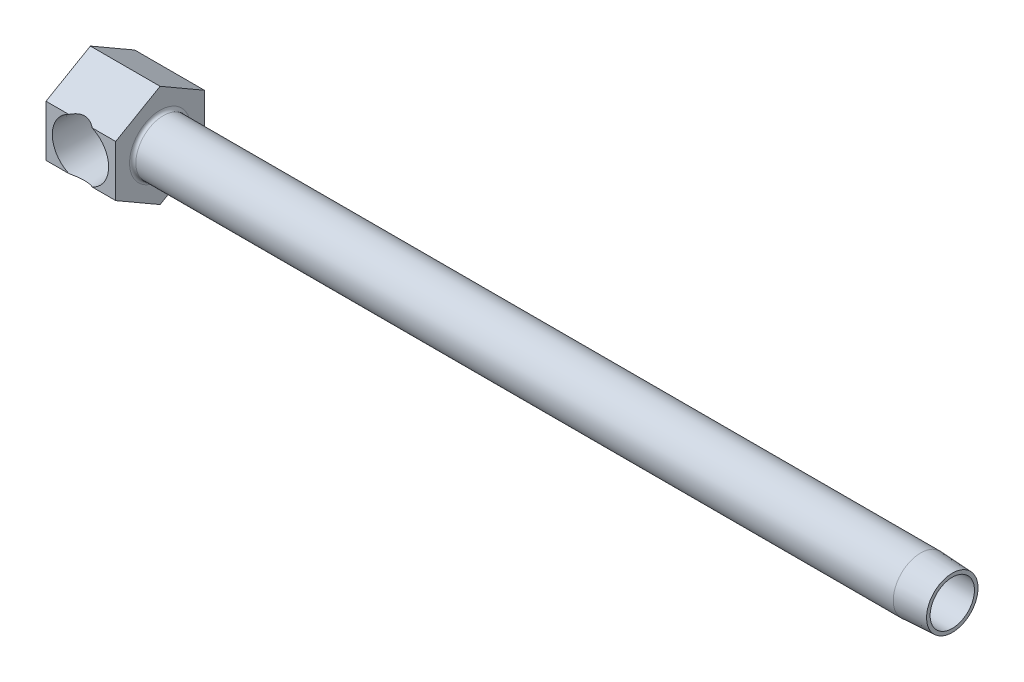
ISO-10303-21;
HEADER;
FILE_DESCRIPTION(('STEP AP214'),'2;1');
FILE_NAME('part.step','',(''),(''),'','','');
FILE_SCHEMA(('AUTOMOTIVE_DESIGN { 1 0 10303 214 1 1 1 1 }'));
ENDSEC;
DATA;
#1=APPLICATION_CONTEXT('core data for automotive mechanical design processes');
#2=APPLICATION_PROTOCOL_DEFINITION('international standard','automotive_design',2000,#1);
#3=PRODUCT_CONTEXT('',#1,'mechanical');
#4=PRODUCT('Part','Part','',(#3));
#5=PRODUCT_RELATED_PRODUCT_CATEGORY('part','',(#4));
#6=PRODUCT_DEFINITION_FORMATION('','',#4);
#7=PRODUCT_DEFINITION_CONTEXT('part definition',#1,'design');
#8=PRODUCT_DEFINITION('design','',#6,#7);
#9=PRODUCT_DEFINITION_SHAPE('','',#8);
#10=(LENGTH_UNIT() NAMED_UNIT(*) SI_UNIT(.MILLI.,.METRE.));
#11=(NAMED_UNIT(*) PLANE_ANGLE_UNIT() SI_UNIT($,.RADIAN.));
#12=(NAMED_UNIT(*) SI_UNIT($,.STERADIAN.) SOLID_ANGLE_UNIT());
#13=UNCERTAINTY_MEASURE_WITH_UNIT(LENGTH_MEASURE(1.E-05),#10,'distance_accuracy_value','');
#14=(GEOMETRIC_REPRESENTATION_CONTEXT(3) GLOBAL_UNCERTAINTY_ASSIGNED_CONTEXT((#13)) GLOBAL_UNIT_ASSIGNED_CONTEXT((#10,
#11,#12)) REPRESENTATION_CONTEXT('',''));
#15=CARTESIAN_POINT('',(0.,0.,0.));
#16=DIRECTION('',(0.,0.,1.));
#17=DIRECTION('',(1.,0.,0.));
#18=AXIS2_PLACEMENT_3D('',#15,#16,#17);
#19=CARTESIAN_POINT('',(63.5,0.,11.1125));
#20=DIRECTION('',(-1.,0.,0.));
#21=DIRECTION('',(0.,0.,1.));
#22=AXIS2_PLACEMENT_3D('',#19,#20,#21);
#23=CYLINDRICAL_SURFACE('',#22,6.858);
#24=CARTESIAN_POINT('',(18.2499,0.,11.1125));
#25=DIRECTION('',(-1.,0.,0.));
#26=DIRECTION('',(0.,-1.,0.));
#27=AXIS2_PLACEMENT_3D('',#24,#25,#26);
#28=CIRCLE('',#27,6.858);
#29=CARTESIAN_POINT('',(18.2499,-6.858,11.1125));
#30=VERTEX_POINT('',#29);
#31=EDGE_CURVE('E174',#30,#30,#28,.F.);
#32=ORIENTED_EDGE('',*,*,#31,.T.);
#33=EDGE_LOOP('',(#32));
#34=FACE_BOUND('',#33,.T.);
#35=CARTESIAN_POINT('',(207.9752,0.,11.1125));
#36=DIRECTION('',(1.,0.,0.));
#37=DIRECTION('',(0.,0.,-1.));
#38=AXIS2_PLACEMENT_3D('',#35,#36,#37);
#39=CIRCLE('',#38,6.858);
#40=CARTESIAN_POINT('',(207.9752,0.,4.2545));
#41=VERTEX_POINT('',#40);
#42=EDGE_CURVE('E218',#41,#41,#39,.T.);
#43=ORIENTED_EDGE('',*,*,#42,.F.);
#44=EDGE_LOOP('',(#43));
#45=FACE_BOUND('',#44,.T.);
#46=ADVANCED_FACE('F15',(#34,#45),#23,.T.);
#47=CARTESIAN_POINT('',(17.4625,6.4158048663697,22.225));
#48=DIRECTION('',(0.,0.,-1.));
#49=DIRECTION('',(0.,1.,0.));
#50=AXIS2_PLACEMENT_3D('',#47,#48,#49);
#51=PLANE('',#50);
#52=CARTESIAN_POINT('',(8.636,0.,22.225));
#53=DIRECTION('',(0.,0.,1.));
#54=DIRECTION('',(1.,0.,0.));
#55=AXIS2_PLACEMENT_3D('',#52,#53,#54);
#56=CIRCLE('',#55,7.05231);
#57=CARTESIAN_POINT('',(5.70811266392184,6.4158048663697,22.225));
#58=VERTEX_POINT('',#57);
#59=CARTESIAN_POINT('',(5.70811266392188,-6.41580486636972,22.225));
#60=VERTEX_POINT('',#59);
#61=EDGE_CURVE('E229',#58,#60,#56,.T.);
#62=ORIENTED_EDGE('',*,*,#61,.F.);
#63=DIRECTION('',(-1.,0.,0.));
#64=VECTOR('',#63,1.);
#65=CARTESIAN_POINT('',(17.4625,6.4158048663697,22.225));
#66=LINE('',#65,#64);
#67=CARTESIAN_POINT('',(0.,6.4158048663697,22.225));
#68=VERTEX_POINT('',#67);
#69=EDGE_CURVE('E158',#58,#68,#66,.T.);
#70=ORIENTED_EDGE('',*,*,#69,.T.);
#71=DIRECTION('',(0.,-1.,0.));
#72=VECTOR('',#71,1.);
#73=CARTESIAN_POINT('',(0.,6.4158048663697,22.225));
#74=LINE('',#73,#72);
#75=CARTESIAN_POINT('',(0.,-6.41580486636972,22.225));
#76=VERTEX_POINT('',#75);
#77=EDGE_CURVE('E128',#68,#76,#74,.T.);
#78=ORIENTED_EDGE('',*,*,#77,.T.);
#79=DIRECTION('',(-1.,0.,0.));
#80=VECTOR('',#79,1.);
#81=CARTESIAN_POINT('',(17.4625,-6.41580486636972,22.225));
#82=LINE('',#81,#80);
#83=EDGE_CURVE('E154',#60,#76,#82,.T.);
#84=ORIENTED_EDGE('',*,*,#83,.F.);
#85=EDGE_LOOP('',(#62,#70,#78,#84));
#86=FACE_BOUND('',#85,.T.);
#87=ADVANCED_FACE('F205',(#86),#51,.F.);
#88=CARTESIAN_POINT('',(11.5638873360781,-6.41580486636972,22.225));
#89=VERTEX_POINT('',#88);
#90=CARTESIAN_POINT('',(11.5638873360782,6.4158048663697,22.225));
#91=VERTEX_POINT('',#90);
#92=EDGE_CURVE('E228',#89,#91,#56,.T.);
#93=ORIENTED_EDGE('',*,*,#92,.F.);
#94=CARTESIAN_POINT('',(17.4625,-6.41580486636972,22.225));
#95=VERTEX_POINT('',#94);
#96=EDGE_CURVE('E155',#95,#89,#82,.T.);
#97=ORIENTED_EDGE('',*,*,#96,.F.);
#98=DIRECTION('',(0.,-1.,0.));
#99=VECTOR('',#98,1.);
#100=CARTESIAN_POINT('',(17.4625,6.4158048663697,22.225));
#101=LINE('',#100,#99);
#102=CARTESIAN_POINT('',(17.4625,6.4158048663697,22.225));
#103=VERTEX_POINT('',#102);
#104=EDGE_CURVE('E145',#103,#95,#101,.T.);
#105=ORIENTED_EDGE('',*,*,#104,.F.);
#106=EDGE_CURVE('E159',#103,#91,#66,.T.);
#107=ORIENTED_EDGE('',*,*,#106,.T.);
#108=EDGE_LOOP('',(#93,#97,#105,#107));
#109=FACE_BOUND('',#108,.T.);
#110=ADVANCED_FACE('F211',(#109),#51,.F.);
#111=CARTESIAN_POINT('',(17.4625,12.8316097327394,11.1125));
#112=DIRECTION('',(0.,-0.866025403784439,-0.5));
#113=DIRECTION('',(0.,0.5,-0.866025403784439));
#114=AXIS2_PLACEMENT_3D('',#111,#112,#113);
#115=PLANE('',#114);
#116=ORIENTED_EDGE('',*,*,#69,.F.);
#117=CARTESIAN_POINT('',(8.636,-0.384020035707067,34.002642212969));
#118=DIRECTION('',(0.,-0.866025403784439,-0.5));
#119=DIRECTION('',(0.,-0.5,0.866025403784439));
#120=AXIS2_PLACEMENT_3D('',#117,#118,#119);
#121=ELLIPSE('',#120,14.8098967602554,7.39498405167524);
#122=EDGE_CURVE('E109',#58,#91,#121,.T.);
#123=ORIENTED_EDGE('',*,*,#122,.T.);
#124=ORIENTED_EDGE('',*,*,#106,.F.);
#125=DIRECTION('',(0.,-0.5,0.866025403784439));
#126=VECTOR('',#125,1.);
#127=CARTESIAN_POINT('',(17.4625,12.8316097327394,11.1125));
#128=LINE('',#127,#126);
#129=CARTESIAN_POINT('',(17.4625,12.8316097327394,11.1125));
#130=VERTEX_POINT('',#129);
#131=EDGE_CURVE('E143',#130,#103,#128,.T.);
#132=ORIENTED_EDGE('',*,*,#131,.F.);
#133=DIRECTION('',(-1.,0.,0.));
#134=VECTOR('',#133,1.);
#135=CARTESIAN_POINT('',(17.4625,12.8316097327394,11.1125));
#136=LINE('',#135,#134);
#137=CARTESIAN_POINT('',(0.,12.8316097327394,11.1125));
#138=VERTEX_POINT('',#137);
#139=EDGE_CURVE('E162',#130,#138,#136,.T.);
#140=ORIENTED_EDGE('',*,*,#139,.T.);
#141=DIRECTION('',(0.,-0.5,0.866025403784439));
#142=VECTOR('',#141,1.);
#143=CARTESIAN_POINT('',(0.,12.8316097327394,11.1125));
#144=LINE('',#143,#142);
#145=EDGE_CURVE('E124',#138,#68,#144,.T.);
#146=ORIENTED_EDGE('',*,*,#145,.T.);
#147=EDGE_LOOP('',(#116,#123,#124,#132,#140,#146));
#148=FACE_BOUND('',#147,.T.);
#149=ADVANCED_FACE('F257',(#148),#115,.F.);
#150=CARTESIAN_POINT('',(17.4625,-6.41580486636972,22.225));
#151=DIRECTION('',(0.,0.866025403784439,-0.5));
#152=DIRECTION('',(0.,0.5,0.866025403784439));
#153=AXIS2_PLACEMENT_3D('',#150,#151,#152);
#154=PLANE('',#153);
#155=ORIENTED_EDGE('',*,*,#96,.T.);
#156=CARTESIAN_POINT('',(8.636,0.384020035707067,34.0026422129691));
#157=DIRECTION('',(0.,0.866025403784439,-0.5));
#158=DIRECTION('',(0.,0.5,0.866025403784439));
#159=AXIS2_PLACEMENT_3D('',#156,#157,#158);
#160=ELLIPSE('',#159,14.8098967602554,7.39498405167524);
#161=EDGE_CURVE('E34',#89,#60,#160,.T.);
#162=ORIENTED_EDGE('',*,*,#161,.T.);
#163=ORIENTED_EDGE('',*,*,#83,.T.);
#164=DIRECTION('',(0.,-0.5,-0.866025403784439));
#165=VECTOR('',#164,1.);
#166=CARTESIAN_POINT('',(0.,-6.41580486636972,22.225));
#167=LINE('',#166,#165);
#168=CARTESIAN_POINT('',(0.,-12.8316097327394,11.1125));
#169=VERTEX_POINT('',#168);
#170=EDGE_CURVE('E132',#76,#169,#167,.T.);
#171=ORIENTED_EDGE('',*,*,#170,.T.);
#172=DIRECTION('',(-1.,0.,0.));
#173=VECTOR('',#172,1.);
#174=CARTESIAN_POINT('',(17.4625,-12.8316097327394,11.1125));
#175=LINE('',#174,#173);
#176=CARTESIAN_POINT('',(17.4625,-12.8316097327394,11.1125));
#177=VERTEX_POINT('',#176);
#178=EDGE_CURVE('E149',#177,#169,#175,.T.);
#179=ORIENTED_EDGE('',*,*,#178,.F.);
#180=DIRECTION('',(0.,-0.5,-0.866025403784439));
#181=VECTOR('',#180,1.);
#182=CARTESIAN_POINT('',(17.4625,-6.41580486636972,22.225));
#183=LINE('',#182,#181);
#184=EDGE_CURVE('E147',#95,#177,#183,.T.);
#185=ORIENTED_EDGE('',*,*,#184,.F.);
#186=EDGE_LOOP('',(#155,#162,#163,#171,#179,#185));
#187=FACE_BOUND('',#186,.T.);
#188=ADVANCED_FACE('F235',(#187),#154,.F.);
#189=CARTESIAN_POINT('',(17.4625,-12.8316097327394,11.1125));
#190=DIRECTION('',(0.,0.866025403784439,0.5));
#191=DIRECTION('',(0.,-0.5,0.866025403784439));
#192=AXIS2_PLACEMENT_3D('',#189,#190,#191);
#193=PLANE('',#192);
#194=DIRECTION('',(0.,0.5,-0.866025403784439));
#195=VECTOR('',#194,1.);
#196=CARTESIAN_POINT('',(0.,-12.8316097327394,11.1125));
#197=LINE('',#196,#195);
#198=CARTESIAN_POINT('',(0.,-6.41580486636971,0.));
#199=VERTEX_POINT('',#198);
#200=EDGE_CURVE('E117',#169,#199,#197,.T.);
#201=ORIENTED_EDGE('',*,*,#200,.T.);
#202=DIRECTION('',(-1.,0.,0.));
#203=VECTOR('',#202,1.);
#204=CARTESIAN_POINT('',(17.4625,-6.41580486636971,0.));
#205=LINE('',#204,#203);
#206=CARTESIAN_POINT('',(17.4625,-6.41580486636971,0.));
#207=VERTEX_POINT('',#206);
#208=EDGE_CURVE('E168',#207,#199,#205,.T.);
#209=ORIENTED_EDGE('',*,*,#208,.F.);
#210=DIRECTION('',(0.,0.5,-0.866025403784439));
#211=VECTOR('',#210,1.);
#212=CARTESIAN_POINT('',(17.4625,-12.8316097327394,11.1125));
#213=LINE('',#212,#211);
#214=EDGE_CURVE('E135',#177,#207,#213,.T.);
#215=ORIENTED_EDGE('',*,*,#214,.F.);
#216=ORIENTED_EDGE('',*,*,#178,.T.);
#217=EDGE_LOOP('',(#201,#209,#215,#216));
#218=FACE_BOUND('',#217,.T.);
#219=ADVANCED_FACE('F247',(#218),#193,.F.);
#220=CARTESIAN_POINT('',(17.4625,-6.41580486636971,0.));
#221=DIRECTION('',(0.,0.,1.));
#222=DIRECTION('',(1.,0.,0.));
#223=AXIS2_PLACEMENT_3D('',#220,#221,#222);
#224=PLANE('',#223);
#225=DIRECTION('',(0.,1.,0.));
#226=VECTOR('',#225,1.);
#227=CARTESIAN_POINT('',(0.,-6.41580486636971,0.));
#228=LINE('',#227,#226);
#229=CARTESIAN_POINT('',(0.,6.41580486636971,0.));
#230=VERTEX_POINT('',#229);
#231=EDGE_CURVE('E118',#199,#230,#228,.T.);
#232=ORIENTED_EDGE('',*,*,#231,.T.);
#233=DIRECTION('',(-1.,0.,0.));
#234=VECTOR('',#233,1.);
#235=CARTESIAN_POINT('',(17.4625,6.41580486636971,0.));
#236=LINE('',#235,#234);
#237=CARTESIAN_POINT('',(17.4625,6.41580486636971,0.));
#238=VERTEX_POINT('',#237);
#239=EDGE_CURVE('E165',#238,#230,#236,.T.);
#240=ORIENTED_EDGE('',*,*,#239,.F.);
#241=DIRECTION('',(0.,1.,0.));
#242=VECTOR('',#241,1.);
#243=CARTESIAN_POINT('',(17.4625,-6.41580486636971,0.));
#244=LINE('',#243,#242);
#245=EDGE_CURVE('E139',#207,#238,#244,.T.);
#246=ORIENTED_EDGE('',*,*,#245,.F.);
#247=ORIENTED_EDGE('',*,*,#208,.T.);
#248=EDGE_LOOP('',(#232,#240,#246,#247));
#249=FACE_BOUND('',#248,.T.);
#250=ADVANCED_FACE('F264',(#249),#224,.F.);
#251=CARTESIAN_POINT('',(17.4625,6.4158048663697,0.));
#252=DIRECTION('',(0.,-0.866025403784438,0.5));
#253=DIRECTION('',(0.,-0.5,-0.866025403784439));
#254=AXIS2_PLACEMENT_3D('',#251,#252,#253);
#255=PLANE('',#254);
#256=DIRECTION('',(0.,0.5,0.866025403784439));
#257=VECTOR('',#256,1.);
#258=CARTESIAN_POINT('',(0.,6.4158048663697,0.));
#259=LINE('',#258,#257);
#260=EDGE_CURVE('E121',#230,#138,#259,.T.);
#261=ORIENTED_EDGE('',*,*,#260,.T.);
#262=ORIENTED_EDGE('',*,*,#139,.F.);
#263=DIRECTION('',(0.,0.5,0.866025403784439));
#264=VECTOR('',#263,1.);
#265=CARTESIAN_POINT('',(17.4625,6.4158048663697,0.));
#266=LINE('',#265,#264);
#267=EDGE_CURVE('E141',#238,#130,#266,.T.);
#268=ORIENTED_EDGE('',*,*,#267,.F.);
#269=ORIENTED_EDGE('',*,*,#239,.T.);
#270=EDGE_LOOP('',(#261,#262,#268,#269));
#271=FACE_BOUND('',#270,.T.);
#272=ADVANCED_FACE('F261',(#271),#255,.F.);
#273=CARTESIAN_POINT('',(17.4625,-19.2474145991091,22.225));
#274=DIRECTION('',(-1.,0.,0.));
#275=DIRECTION('',(0.,-1.,0.));
#276=AXIS2_PLACEMENT_3D('',#273,#274,#275);
#277=PLANE('',#276);
#278=CARTESIAN_POINT('',(17.4625,0.,11.1125));
#279=DIRECTION('',(-1.,0.,0.));
#280=DIRECTION('',(0.,-1.,0.));
#281=AXIS2_PLACEMENT_3D('',#278,#279,#280);
#282=CIRCLE('',#281,7.6454);
#283=CARTESIAN_POINT('',(17.4625,-7.6454,11.1125));
#284=VERTEX_POINT('',#283);
#285=EDGE_CURVE('E171',#284,#284,#282,.T.);
#286=ORIENTED_EDGE('',*,*,#285,.T.);
#287=EDGE_LOOP('',(#286));
#288=FACE_BOUND('',#287,.T.);
#289=ORIENTED_EDGE('',*,*,#214,.T.);
#290=ORIENTED_EDGE('',*,*,#245,.T.);
#291=ORIENTED_EDGE('',*,*,#267,.T.);
#292=ORIENTED_EDGE('',*,*,#131,.T.);
#293=ORIENTED_EDGE('',*,*,#104,.T.);
#294=ORIENTED_EDGE('',*,*,#184,.T.);
#295=EDGE_LOOP('',(#289,#290,#291,#292,#293,#294));
#296=FACE_BOUND('',#295,.T.);
#297=ADVANCED_FACE('F250',(#288,#296),#277,.F.);
#298=CARTESIAN_POINT('',(0.,-19.2474145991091,22.225));
#299=DIRECTION('',(-1.,0.,0.));
#300=DIRECTION('',(0.,-1.,0.));
#301=AXIS2_PLACEMENT_3D('',#298,#299,#300);
#302=PLANE('',#301);
#303=ORIENTED_EDGE('',*,*,#200,.F.);
#304=ORIENTED_EDGE('',*,*,#170,.F.);
#305=ORIENTED_EDGE('',*,*,#77,.F.);
#306=ORIENTED_EDGE('',*,*,#145,.F.);
#307=ORIENTED_EDGE('',*,*,#260,.F.);
#308=ORIENTED_EDGE('',*,*,#231,.F.);
#309=EDGE_LOOP('',(#303,#304,#305,#306,#307,#308));
#310=FACE_BOUND('',#309,.T.);
#311=ADVANCED_FACE('F243',(#310),#302,.T.);
#312=CARTESIAN_POINT('',(18.2499,0.,11.1125));
#313=DIRECTION('',(-1.,0.,0.));
#314=DIRECTION('',(0.,-1.,0.));
#315=AXIS2_PLACEMENT_3D('',#312,#313,#314);
#316=TOROIDAL_SURFACE('',#315,7.6454,0.7874);
#317=ORIENTED_EDGE('',*,*,#31,.F.);
#318=EDGE_LOOP('',(#317));
#319=FACE_BOUND('',#318,.T.);
#320=ORIENTED_EDGE('',*,*,#285,.F.);
#321=EDGE_LOOP('',(#320));
#322=FACE_BOUND('',#321,.T.);
#323=ADVANCED_FACE('F282',(#319,#322),#316,.F.);
#324=CARTESIAN_POINT('',(63.5,0.,11.1125));
#325=DIRECTION('',(1.,0.,0.));
#326=DIRECTION('',(0.,0.,-1.));
#327=AXIS2_PLACEMENT_3D('',#324,#325,#326);
#328=CYLINDRICAL_SURFACE('',#327,5.5499);
#329=DIRECTION('',(1.,0.,0.));
#330=VECTOR('',#329,1.);
#331=CARTESIAN_POINT('',(63.5,1.29165930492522,5.715));
#332=LINE('',#331,#330);
#333=CARTESIAN_POINT('',(15.0655177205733,1.29165930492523,5.715));
#334=VERTEX_POINT('',#333);
#335=CARTESIAN_POINT('',(14.0465577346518,1.29165930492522,5.715));
#336=VERTEX_POINT('',#335);
#337=EDGE_CURVE('E27',#334,#336,#332,.F.);
#338=ORIENTED_EDGE('',*,*,#337,.T.);
#339=CARTESIAN_POINT('',(14.0465577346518,1.29165930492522,5.715));
#340=CARTESIAN_POINT('',(14.0725617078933,1.1828202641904,5.68893317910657));
#341=CARTESIAN_POINT('',(14.0954190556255,1.0724477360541,5.66602138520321));
#342=CARTESIAN_POINT('',(14.1345363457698,0.849345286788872,5.62681178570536));
#343=CARTESIAN_POINT('',(14.1507939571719,0.736614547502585,5.61051631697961));
#344=CARTESIAN_POINT('',(14.1760383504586,0.512691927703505,5.58521342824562));
#345=CARTESIAN_POINT('',(14.1852120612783,0.401542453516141,5.57601863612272));
#346=CARTESIAN_POINT('',(14.1968530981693,0.17856718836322,5.56435088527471));
#347=CARTESIAN_POINT('',(14.1993222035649,0.0667415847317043,5.56187614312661));
#348=CARTESIAN_POINT('',(14.1975723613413,-0.14949882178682,5.56362999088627));
#349=CARTESIAN_POINT('',(14.193779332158,-0.253921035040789,5.56743168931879));
#350=CARTESIAN_POINT('',(14.1803598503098,-0.462026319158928,5.58088200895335));
#351=CARTESIAN_POINT('',(14.1707325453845,-0.565709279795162,5.59053148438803));
#352=CARTESIAN_POINT('',(14.1454600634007,-0.774399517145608,5.61586264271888));
#353=CARTESIAN_POINT('',(14.12966315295,-0.87936981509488,5.63169642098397));
#354=CARTESIAN_POINT('',(14.092340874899,-1.08722287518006,5.6691068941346));
#355=CARTESIAN_POINT('',(14.0708169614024,-1.1901061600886,5.69068213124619));
#356=CARTESIAN_POINT('',(14.0465577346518,-1.29165930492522,5.715));
#357=B_SPLINE_CURVE_WITH_KNOTS('',3,(#339,#340,#341,#342,#343,#344,#345,#346,#347,#348,#349,
#350,#351,#352,#353,#354,#355,#356),.UNSPECIFIED.,.F.,.F.,(4,2,2,2,2,2,2,2,4),(0.,
0.344637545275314,0.689396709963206,1.02471413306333,1.35994255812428,1.67329546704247,
1.98669416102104,2.30834220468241,2.62990865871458),.UNSPECIFIED.);
#358=CARTESIAN_POINT('',(14.0465577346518,-1.29165930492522,5.715));
#359=VERTEX_POINT('',#358);
#360=EDGE_CURVE('E10',#336,#359,#357,.T.);
#361=ORIENTED_EDGE('',*,*,#360,.T.);
#362=DIRECTION('',(1.,0.,0.));
#363=VECTOR('',#362,1.);
#364=CARTESIAN_POINT('',(63.5,-1.29165930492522,5.715));
#365=LINE('',#364,#363);
#366=CARTESIAN_POINT('',(15.0655177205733,-1.29165930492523,5.715));
#367=VERTEX_POINT('',#366);
#368=EDGE_CURVE('E184',#359,#367,#365,.T.);
#369=ORIENTED_EDGE('',*,*,#368,.T.);
#370=CARTESIAN_POINT('',(15.0656795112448,-1.29082327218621,5.71480000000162));
#371=CARTESIAN_POINT('',(15.0372536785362,-1.43791824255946,5.7499521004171));
#372=CARTESIAN_POINT('',(15.0041876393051,-1.58262926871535,5.79093746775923));
#373=CARTESIAN_POINT('',(14.9298152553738,-1.86616189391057,5.88364074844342));
#374=CARTESIAN_POINT('',(14.8885204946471,-2.00499144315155,5.93534357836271));
#375=CARTESIAN_POINT('',(14.7990709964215,-2.27477346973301,6.0481148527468));
#376=CARTESIAN_POINT('',(14.7509848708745,-2.40578805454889,6.10909004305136));
#377=CARTESIAN_POINT('',(14.6486806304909,-2.66083130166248,6.2399326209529));
#378=CARTESIAN_POINT('',(14.5944604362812,-2.78485757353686,6.30980302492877));
#379=CARTESIAN_POINT('',(14.4812536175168,-3.02482355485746,6.4572285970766));
#380=CARTESIAN_POINT('',(14.4222960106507,-3.1408054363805,6.53473755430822));
#381=CARTESIAN_POINT('',(14.3003856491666,-3.365215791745,6.6970845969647));
#382=CARTESIAN_POINT('',(14.2374332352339,-3.47364490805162,6.78192205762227));
#383=CARTESIAN_POINT('',(14.0435453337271,-3.78827180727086,7.04729631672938));
#384=CARTESIAN_POINT('',(13.9079456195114,-3.9830565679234,7.23822682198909));
#385=CARTESIAN_POINT('',(13.689310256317,-4.26816238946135,7.56146618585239));
#386=CARTESIAN_POINT('',(13.6074310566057,-4.3686517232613,7.68585924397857));
#387=CARTESIAN_POINT('',(13.4442899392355,-4.55879004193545,7.94320688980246));
#388=CARTESIAN_POINT('',(13.3630282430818,-4.6484352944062,8.07616440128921));
#389=CARTESIAN_POINT('',(13.2036424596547,-4.81645966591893,8.35044586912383));
#390=CARTESIAN_POINT('',(13.1255135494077,-4.89485662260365,8.49175606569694));
#391=CARTESIAN_POINT('',(12.9752684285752,-5.04004510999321,8.78316437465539));
#392=CARTESIAN_POINT('',(12.9031480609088,-5.10684469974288,8.93325628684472));
#393=CARTESIAN_POINT('',(12.757824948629,-5.23785122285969,9.26762207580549));
#394=CARTESIAN_POINT('',(12.686320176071,-5.29990617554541,9.45350692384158));
#395=CARTESIAN_POINT('',(12.5645322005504,-5.40502712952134,9.83721903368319));
#396=CARTESIAN_POINT('',(12.5142004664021,-5.44813656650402,10.035017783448));
#397=CARTESIAN_POINT('',(12.4606756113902,-5.49679755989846,10.3395644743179));
#398=CARTESIAN_POINT('',(12.4464754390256,-5.51038902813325,10.443158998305));
#399=CARTESIAN_POINT('',(12.4264834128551,-5.5317354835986,10.6517762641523));
#400=CARTESIAN_POINT('',(12.4206908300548,-5.53949097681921,10.7567988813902));
#401=CARTESIAN_POINT('',(12.4179376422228,-5.54899639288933,10.9671942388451));
#402=CARTESIAN_POINT('',(12.4209736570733,-5.55074861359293,11.0725668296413));
#403=CARTESIAN_POINT('',(12.4357182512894,-5.54828805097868,11.2826067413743));
#404=CARTESIAN_POINT('',(12.4474268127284,-5.54407527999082,11.3872740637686));
#405=CARTESIAN_POINT('',(12.4900727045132,-5.52483789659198,11.6684350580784));
#406=CARTESIAN_POINT('',(12.5287513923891,-5.5042766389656,11.8434168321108));
#407=CARTESIAN_POINT('',(12.6245766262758,-5.44793106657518,12.1856637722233));
#408=CARTESIAN_POINT('',(12.6817493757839,-5.41212512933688,12.3529176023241));
#409=CARTESIAN_POINT('',(12.8020710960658,-5.33165221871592,12.6608364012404));
#410=CARTESIAN_POINT('',(12.8638814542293,-5.28838367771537,12.8024081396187));
#411=CARTESIAN_POINT('',(12.9946271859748,-5.19196308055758,13.0788046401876));
#412=CARTESIAN_POINT('',(13.0635675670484,-5.13880405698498,13.2136245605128));
#413=CARTESIAN_POINT('',(13.2061680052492,-5.0230773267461,13.476991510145));
#414=CARTESIAN_POINT('',(13.2798387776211,-4.96048779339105,13.6055230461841));
#415=CARTESIAN_POINT('',(13.4297455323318,-4.82635797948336,13.8561944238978));
#416=CARTESIAN_POINT('',(13.505980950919,-4.75481965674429,13.9783356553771));
#417=CARTESIAN_POINT('',(13.664111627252,-4.59832635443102,14.2236446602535));
#418=CARTESIAN_POINT('',(13.7460684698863,-4.51281916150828,14.3464205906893));
#419=CARTESIAN_POINT('',(13.9094765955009,-4.33199713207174,14.5849036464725));
#420=CARTESIAN_POINT('',(13.9909278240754,-4.23668125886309,14.7006100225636));
#421=CARTESIAN_POINT('',(14.1517819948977,-4.03638256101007,14.9245234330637));
#422=CARTESIAN_POINT('',(14.231187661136,-3.93141354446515,15.0327408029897));
#423=CARTESIAN_POINT('',(14.3867175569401,-3.71172769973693,15.2413555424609));
#424=CARTESIAN_POINT('',(14.4628409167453,-3.59700831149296,15.3417508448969));
#425=CARTESIAN_POINT('',(14.668135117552,-3.26437402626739,15.6091426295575));
#426=CARTESIAN_POINT('',(14.7924014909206,-3.03572507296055,15.7670513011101));
#427=CARTESIAN_POINT('',(14.961823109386,-2.67104021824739,15.9794040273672));
#428=CARTESIAN_POINT('',(15.0154673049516,-2.54586009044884,16.0461031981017));
#429=CARTESIAN_POINT('',(15.1161712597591,-2.28856209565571,16.1705894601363));
#430=CARTESIAN_POINT('',(15.1632322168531,-2.15644549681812,16.2283781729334));
#431=CARTESIAN_POINT('',(15.2428146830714,-1.9076542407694,16.3256678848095));
#432=CARTESIAN_POINT('',(15.2764575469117,-1.79190088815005,16.3666154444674));
#433=CARTESIAN_POINT('',(15.3378292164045,-1.55651069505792,16.4410921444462));
#434=CARTESIAN_POINT('',(15.3655591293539,-1.43687458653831,16.4746226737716));
#435=CARTESIAN_POINT('',(15.4145953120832,-1.19439983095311,16.5337884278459));
#436=CARTESIAN_POINT('',(15.4359031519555,-1.0715619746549,16.5594255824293));
#437=CARTESIAN_POINT('',(15.4716760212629,-0.823504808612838,16.6024058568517));
#438=CARTESIAN_POINT('',(15.4861437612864,-0.698286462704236,16.6197522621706));
#439=CARTESIAN_POINT('',(15.5079865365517,-0.445852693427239,16.645922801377));
#440=CARTESIAN_POINT('',(15.5153340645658,-0.318631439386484,16.6547138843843));
#441=CARTESIAN_POINT('',(15.522677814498,-0.063671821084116,16.6635004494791));
#442=CARTESIAN_POINT('',(15.5226740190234,0.0640665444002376,16.6634959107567));
#443=CARTESIAN_POINT('',(15.5153149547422,0.319031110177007,16.6546910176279));
#444=CARTESIAN_POINT('',(15.5079593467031,0.446257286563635,16.64589025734));
#445=CARTESIAN_POINT('',(15.4860583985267,0.699182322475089,16.6196499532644));
#446=CARTESIAN_POINT('',(15.4715132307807,0.824881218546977,16.6022106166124));
#447=CARTESIAN_POINT('',(15.4365532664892,1.06681669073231,16.5602063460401));
#448=CARTESIAN_POINT('',(15.4165150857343,1.18318753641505,16.5360979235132));
#449=CARTESIAN_POINT('',(15.370668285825,1.41308832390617,16.4807930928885));
#450=CARTESIAN_POINT('',(15.3448577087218,1.52661728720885,16.4495942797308));
#451=CARTESIAN_POINT('',(15.2593968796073,1.8619852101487,16.3459550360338));
#452=CARTESIAN_POINT('',(15.1916934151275,2.07876635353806,16.2634431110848));
#453=CARTESIAN_POINT('',(15.0313088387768,2.51543897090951,16.0659794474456));
#454=CARTESIAN_POINT('',(14.9368359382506,2.73357267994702,15.9486491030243));
#455=CARTESIAN_POINT('',(14.7321201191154,3.14711164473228,15.6903358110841));
#456=CARTESIAN_POINT('',(14.6218705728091,3.34250728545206,15.549342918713));
#457=CARTESIAN_POINT('',(14.3660176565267,3.74896640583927,15.2149275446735));
#458=CARTESIAN_POINT('',(14.217881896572,3.95452519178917,15.0167316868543));
#459=CARTESIAN_POINT('',(13.9905991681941,4.23685264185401,14.7000501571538));
#460=CARTESIAN_POINT('',(13.9138995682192,4.32671599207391,14.5911203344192));
#461=CARTESIAN_POINT('',(13.7600052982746,4.49774000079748,14.366972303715));
#462=CARTESIAN_POINT('',(13.682810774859,4.57890311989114,14.2517558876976));
#463=CARTESIAN_POINT('',(13.5283146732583,4.73340315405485,14.0136509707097));
#464=CARTESIAN_POINT('',(13.4510233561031,4.80663208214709,13.8906858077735));
#465=CARTESIAN_POINT('',(13.2989020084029,4.94395744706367,13.6382338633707));
#466=CARTESIAN_POINT('',(13.2240725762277,5.00805167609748,13.5087455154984));
#467=CARTESIAN_POINT('',(13.0790371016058,5.12664196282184,13.2432341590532));
#468=CARTESIAN_POINT('',(13.0088235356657,5.18115389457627,13.107222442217));
#469=CARTESIAN_POINT('',(12.8755190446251,5.28008101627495,12.8283198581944));
#470=CARTESIAN_POINT('',(12.8124234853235,5.3245027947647,12.6854335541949));
#471=CARTESIAN_POINT('',(12.6833891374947,5.4112685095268,12.3591277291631));
#472=CARTESIAN_POINT('',(12.6200540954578,5.45085356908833,12.1738679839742));
#473=CARTESIAN_POINT('',(12.5423523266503,5.49611259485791,11.8892630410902));
#474=CARTESIAN_POINT('',(12.5193453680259,5.50884182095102,11.7933456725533));
#475=CARTESIAN_POINT('',(12.4799604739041,5.52933440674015,11.5996550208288));
#476=CARTESIAN_POINT('',(12.4635791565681,5.53710030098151,11.5018827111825));
#477=CARTESIAN_POINT('',(12.4380468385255,5.54748556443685,11.3040796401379));
#478=CARTESIAN_POINT('',(12.4289726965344,5.55005064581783,11.2040359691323));
#479=CARTESIAN_POINT('',(12.418786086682,5.54973569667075,11.0035516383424));
#480=CARTESIAN_POINT('',(12.4176731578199,5.54685598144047,10.9031110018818));
#481=CARTESIAN_POINT('',(12.4234254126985,5.53566138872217,10.7027211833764));
#482=CARTESIAN_POINT('',(12.4302942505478,5.52734402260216,10.6027722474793));
#483=CARTESIAN_POINT('',(12.4515981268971,5.5054275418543,10.4042328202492));
#484=CARTESIAN_POINT('',(12.4660373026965,5.4918255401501,10.3056431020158));
#485=CARTESIAN_POINT('',(12.5044721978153,5.45712893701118,10.0955734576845));
#486=CARTESIAN_POINT('',(12.5295946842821,5.43520467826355,9.98443807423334));
#487=CARTESIAN_POINT('',(12.5874763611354,5.38514310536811,9.76556012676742));
#488=CARTESIAN_POINT('',(12.6202414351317,5.35700100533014,9.65782024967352));
#489=CARTESIAN_POINT('',(12.6919869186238,5.29489520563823,9.44585515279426));
#490=CARTESIAN_POINT('',(12.7309829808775,5.2609168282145,9.34163960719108));
#491=CARTESIAN_POINT('',(12.813732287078,5.18758941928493,9.13712531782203));
#492=CARTESIAN_POINT('',(12.8574843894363,5.14824167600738,9.03682564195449));
#493=CARTESIAN_POINT('',(12.9739768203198,5.04107082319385,8.78510193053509));
#494=CARTESIAN_POINT('',(13.0492646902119,4.96961386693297,8.63639571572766));
#495=CARTESIAN_POINT('',(13.2048344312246,4.81508369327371,8.34787401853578));
#496=CARTESIAN_POINT('',(13.2851189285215,4.73200433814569,8.20806329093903));
#497=CARTESIAN_POINT('',(13.4480056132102,4.55446924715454,7.93688996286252));
#498=CARTESIAN_POINT('',(13.5306114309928,4.45999483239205,7.80554179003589));
#499=CARTESIAN_POINT('',(13.6957298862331,4.25996324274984,7.55156980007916));
#500=CARTESIAN_POINT('',(13.7782425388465,4.15440825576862,7.42894426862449));
#501=CARTESIAN_POINT('',(13.9441031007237,3.92836612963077,7.18853642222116));
#502=CARTESIAN_POINT('',(14.0273794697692,3.80748613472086,7.0710730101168));
#503=CARTESIAN_POINT('',(14.1898135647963,3.55392137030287,6.84638586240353));
#504=CARTESIAN_POINT('',(14.2689704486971,3.42123420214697,6.73916421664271));
#505=CARTESIAN_POINT('',(14.420885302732,3.14485348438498,6.53641941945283));
#506=CARTESIAN_POINT('',(14.4936705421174,3.0012123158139,6.44084565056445));
#507=CARTESIAN_POINT('',(14.6312840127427,2.70291662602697,6.2621549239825));
#508=CARTESIAN_POINT('',(14.6961173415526,2.54826926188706,6.17902997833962));
#509=CARTESIAN_POINT('',(14.8204425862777,2.21665612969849,6.02094073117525));
#510=CARTESIAN_POINT('',(14.8791782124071,2.03888590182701,5.94704372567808));
#511=CARTESIAN_POINT('',(14.957111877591,1.76426185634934,5.84958505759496));
#512=CARTESIAN_POINT('',(14.9814347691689,1.67119024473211,5.81928093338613));
#513=CARTESIAN_POINT('',(15.0263924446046,1.48269404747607,5.76341790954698));
#514=CARTESIAN_POINT('',(15.047024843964,1.38726798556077,5.73786207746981));
#515=CARTESIAN_POINT('',(15.0656795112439,1.2908232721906,5.71480000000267));
#516=B_SPLINE_CURVE_WITH_KNOTS('',3,(#370,#371,#372,#373,#374,#375,#376,#377,#378,#379,#380,
#381,#382,#383,#384,#385,#386,#387,#388,#389,#390,#391,#392,#393,#394,#395,#396,#397,#398,#399,
#400,#401,#402,#403,#404,#405,#406,#407,#408,#409,#410,#411,#412,#413,#414,#415,#416,#417,#418,
#419,#420,#421,#422,#423,#424,#425,#426,#427,#428,#429,#430,#431,#432,#433,#434,#435,#436,#437,
#438,#439,#440,#441,#442,#443,#444,#445,#446,#447,#448,#449,#450,#451,#452,#453,#454,#455,#456,
#457,#458,#459,#460,#461,#462,#463,#464,#465,#466,#467,#468,#469,#470,#471,#472,#473,#474,#475,
#476,#477,#478,#479,#480,#481,#482,#483,#484,#485,#486,#487,#488,#489,#490,#491,#492,#493,#494,
#495,#496,#497,#498,#499,#500,#501,#502,#503,#504,#505,#506,#507,#508,#509,#510,#511,#512,#513,
#514,#515),.UNSPECIFIED.,.F.,.F.,(4,2,2,2,2,2,2,2,2,2,2,2,2,2,2,2,2,2,2,2,2,2,2,2,2,2,2,2,2,2,2,
2,2,2,2,2,2,2,2,2,2,2,2,2,2,2,2,2,2,2,2,2,2,2,2,2,2,2,2,2,2,2,2,2,2,2,2,2,2,2,2,2,4),(0.,
0.461329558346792,0.922014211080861,1.37833951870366,1.83481998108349,2.2886910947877,
2.74252355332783,3.65304009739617,4.19159436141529,4.73033346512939,5.26820855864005,
5.80570837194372,6.42981366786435,7.05248053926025,7.36837231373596,7.68423669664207,
7.99998016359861,8.31572297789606,8.85459341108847,9.39423071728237,9.87481564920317,
10.3557404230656,10.837795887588,11.3197460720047,11.8310943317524,12.3424966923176,
12.8531785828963,13.3639949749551,14.2729996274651,14.7275015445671,15.1819206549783,
15.5634665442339,15.9449409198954,16.3263219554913,16.707551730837,17.0902484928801,
17.472946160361,17.8556614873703,18.2383676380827,18.5995247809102,18.9608046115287,
19.682873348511,20.4753483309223,21.2681572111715,22.2295647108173,22.7113905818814,
23.1930798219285,23.6806666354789,24.1683710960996,24.6552598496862,25.1418297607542,
25.7388115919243,26.0368814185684,26.3347989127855,26.6358104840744,26.9368046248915,
27.237936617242,27.5392333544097,27.8867825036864,28.2346001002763,28.5833055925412,
28.9319275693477,29.4751694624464,30.0186993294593,30.5631325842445,31.1074585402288,
31.6708023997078,32.2342609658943,32.7951763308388,33.3557302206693,33.9579898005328,
34.2603814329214,34.5629677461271),.UNSPECIFIED.);
#517=EDGE_CURVE('E177',#367,#334,#516,.T.);
#518=ORIENTED_EDGE('',*,*,#517,.T.);
#519=EDGE_LOOP('',(#338,#361,#369,#518));
#520=FACE_BOUND('',#519,.T.);
#521=CARTESIAN_POINT('',(215.9,0.,11.1125));
#522=DIRECTION('',(1.,0.,0.));
#523=DIRECTION('',(0.,0.,-1.));
#524=AXIS2_PLACEMENT_3D('',#521,#522,#523);
#525=CIRCLE('',#524,5.5499);
#526=CARTESIAN_POINT('',(215.9,0.,5.5626));
#527=VERTEX_POINT('',#526);
#528=EDGE_CURVE('E223',#527,#527,#525,.T.);
#529=ORIENTED_EDGE('',*,*,#528,.T.);
#530=EDGE_LOOP('',(#529));
#531=FACE_BOUND('',#530,.T.);
#532=ADVANCED_FACE('F185',(#520,#531),#328,.F.);
#533=CARTESIAN_POINT('',(14.1986,0.,5.715));
#534=DIRECTION('',(0.,0.,-1.));
#535=DIRECTION('',(-1.,0.,0.));
#536=AXIS2_PLACEMENT_3D('',#533,#534,#535);
#537=PLANE('',#536);
#538=CARTESIAN_POINT('',(8.636,0.,5.715));
#539=DIRECTION('',(0.,0.,1.));
#540=DIRECTION('',(1.,0.,0.));
#541=AXIS2_PLACEMENT_3D('',#538,#539,#540);
#542=CIRCLE('',#541,6.55797849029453);
#543=EDGE_CURVE('E41',#334,#367,#542,.T.);
#544=ORIENTED_EDGE('',*,*,#543,.T.);
#545=ORIENTED_EDGE('',*,*,#368,.F.);
#546=CARTESIAN_POINT('',(8.636,0.,5.715));
#547=DIRECTION('',(0.,0.,1.));
#548=DIRECTION('',(1.,0.,0.));
#549=AXIS2_PLACEMENT_3D('',#546,#547,#548);
#550=CIRCLE('',#549,5.5626);
#551=EDGE_CURVE('E107',#336,#359,#550,.T.);
#552=ORIENTED_EDGE('',*,*,#551,.F.);
#553=ORIENTED_EDGE('',*,*,#337,.F.);
#554=EDGE_LOOP('',(#544,#545,#552,#553));
#555=FACE_BOUND('',#554,.T.);
#556=ADVANCED_FACE('F194',(#555),#537,.F.);
#557=CARTESIAN_POINT('',(8.636,0.,22.225));
#558=DIRECTION('',(0.,0.,1.));
#559=DIRECTION('',(1.,0.,0.));
#560=AXIS2_PLACEMENT_3D('',#557,#558,#559);
#561=CYLINDRICAL_SURFACE('',#560,5.5626);
#562=CARTESIAN_POINT('',(8.636,0.,4.445));
#563=DIRECTION('',(0.,0.,1.));
#564=DIRECTION('',(1.,0.,0.));
#565=AXIS2_PLACEMENT_3D('',#562,#563,#564);
#566=CIRCLE('',#565,5.5626);
#567=CARTESIAN_POINT('',(14.1986,0.,4.445));
#568=VERTEX_POINT('',#567);
#569=EDGE_CURVE('E105',#568,#568,#566,.T.);
#570=ORIENTED_EDGE('',*,*,#569,.F.);
#571=EDGE_LOOP('',(#570));
#572=FACE_BOUND('',#571,.T.);
#573=ORIENTED_EDGE('',*,*,#551,.T.);
#574=ORIENTED_EDGE('',*,*,#360,.F.);
#575=EDGE_LOOP('',(#573,#574));
#576=FACE_BOUND('',#575,.T.);
#577=ADVANCED_FACE('F192',(#572,#576),#561,.F.);
#578=CARTESIAN_POINT('',(8.636,0.,22.225));
#579=DIRECTION('',(0.,0.,1.));
#580=DIRECTION('',(1.,0.,0.));
#581=AXIS2_PLACEMENT_3D('',#578,#579,#580);
#582=CONICAL_SURFACE('',#581,7.05231,0.0299323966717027);
#583=ORIENTED_EDGE('',*,*,#543,.F.);
#584=ORIENTED_EDGE('',*,*,#517,.F.);
#585=EDGE_LOOP('',(#583,#584));
#586=FACE_BOUND('',#585,.T.);
#587=ORIENTED_EDGE('',*,*,#61,.T.);
#588=ORIENTED_EDGE('',*,*,#161,.F.);
#589=ORIENTED_EDGE('',*,*,#92,.T.);
#590=ORIENTED_EDGE('',*,*,#122,.F.);
#591=EDGE_LOOP('',(#587,#588,#589,#590));
#592=FACE_BOUND('',#591,.T.);
#593=ADVANCED_FACE('F101',(#586,#592),#582,.F.);
#594=CARTESIAN_POINT('',(8.636,0.,4.445));
#595=DIRECTION('',(0.,0.,1.));
#596=DIRECTION('',(1.,0.,0.));
#597=AXIS2_PLACEMENT_3D('',#594,#595,#596);
#598=CONICAL_SURFACE('',#597,5.5626,1.02974425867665);
#599=CARTESIAN_POINT('',(8.636,0.,1.10265272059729));
#600=VERTEX_POINT('',#599);
#601=VERTEX_LOOP('',#600);
#602=FACE_BOUND('',#601,.T.);
#603=ORIENTED_EDGE('',*,*,#569,.T.);
#604=EDGE_LOOP('',(#603));
#605=FACE_BOUND('',#604,.T.);
#606=ADVANCED_FACE('F97',(#602,#605),#598,.F.);
#607=CARTESIAN_POINT('',(215.9,0.,5.5626));
#608=DIRECTION('',(1.,0.,0.));
#609=DIRECTION('',(0.,0.,-1.));
#610=AXIS2_PLACEMENT_3D('',#607,#608,#609);
#611=PLANE('',#610);
#612=CARTESIAN_POINT('',(215.9,0.,11.1125));
#613=DIRECTION('',(1.,0.,0.));
#614=DIRECTION('',(0.,0.,-1.));
#615=AXIS2_PLACEMENT_3D('',#612,#613,#614);
#616=CIRCLE('',#615,6.44267883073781);
#617=CARTESIAN_POINT('',(215.9,0.,4.66982116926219));
#618=VERTEX_POINT('',#617);
#619=EDGE_CURVE('E220',#618,#618,#616,.T.);
#620=ORIENTED_EDGE('',*,*,#619,.T.);
#621=EDGE_LOOP('',(#620));
#622=FACE_BOUND('',#621,.T.);
#623=ORIENTED_EDGE('',*,*,#528,.F.);
#624=EDGE_LOOP('',(#623));
#625=FACE_BOUND('',#624,.T.);
#626=ADVANCED_FACE('F100',(#622,#625),#611,.T.);
#627=CARTESIAN_POINT('',(215.9,0.,11.1125));
#628=DIRECTION('',(-1.,0.,0.));
#629=DIRECTION('',(0.,0.,1.));
#630=AXIS2_PLACEMENT_3D('',#627,#628,#629);
#631=CONICAL_SURFACE('',#630,6.44267883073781,0.052359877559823);
#632=ORIENTED_EDGE('',*,*,#42,.T.);
#633=EDGE_LOOP('',(#632));
#634=FACE_BOUND('',#633,.T.);
#635=ORIENTED_EDGE('',*,*,#619,.F.);
#636=EDGE_LOOP('',(#635));
#637=FACE_BOUND('',#636,.T.);
#638=ADVANCED_FACE('F300',(#634,#637),#631,.T.);
#639=CLOSED_SHELL('',(#46,#87,#110,#149,#188,#219,#250,#272,#297,#311,#323,#532,#556,#577,#593,
#606,#626,#638));
#640=MANIFOLD_SOLID_BREP('B1',#639);
#641=ADVANCED_BREP_SHAPE_REPRESENTATION('',(#18,#640),#14);
#642=SHAPE_DEFINITION_REPRESENTATION(#9,#641);
ENDSEC;
END-ISO-10303-21;
